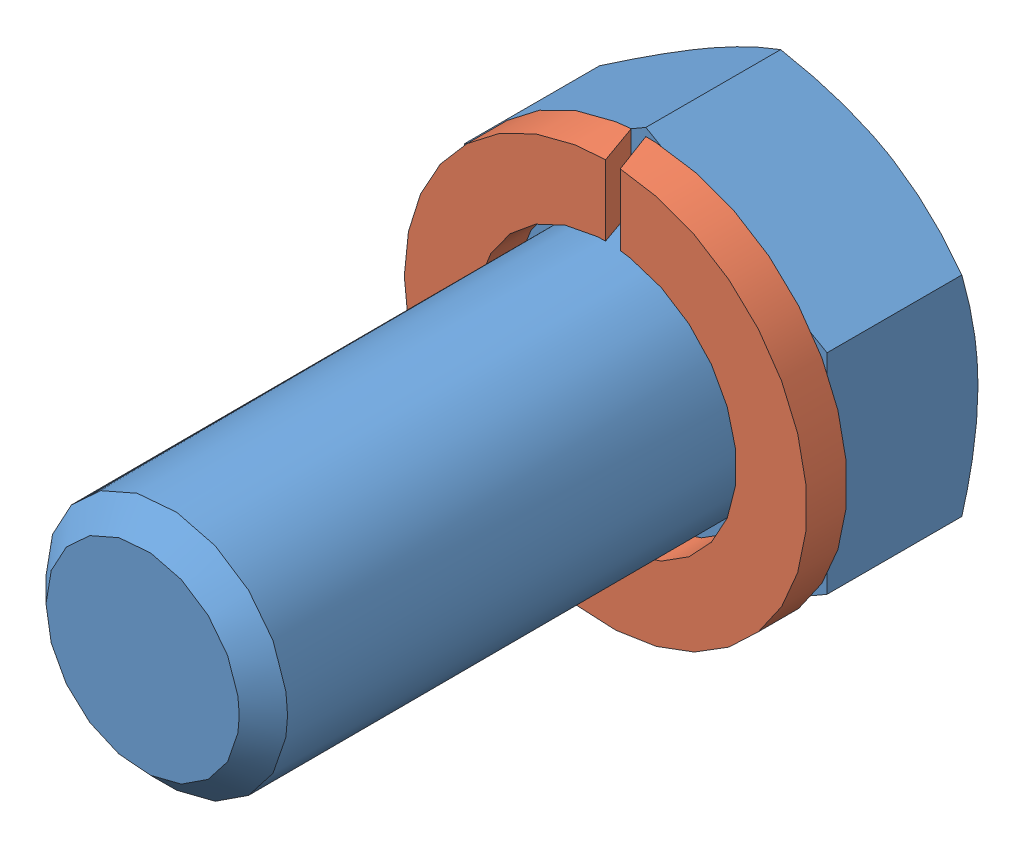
SolidWorks assembly Assemblage3.sldasm, configuration Default (file format 3100). Lengths in mm.
Overall size (20 20.78 32.5).
2 component instances, 2 part files, 2 mates.
Components (placement in the parent):
- VisHM12x25-1: VisHM12x25.SLDPRT [Défaut] at (0.3465 5.4562 -12.6397) size (18 20.78 32.5)
- Rondelle_grower W12-1: Rondelle_grower W12.SLDPRT [Défaut] at (0.3465 5.4562 -12.6397) x (0 0 1) z (-1 0 0) size (2 20 20)
Mates (geometry in assembly coordinates):
- Coaxiale1: concentric: cylinder of VisHM12x25-1; cylinder of Rondelle_grower W12-1
- Coïncidente1: coincident anti-aligned: plane of VisHM12x25-1; plane of Rondelle_grower W12-1
